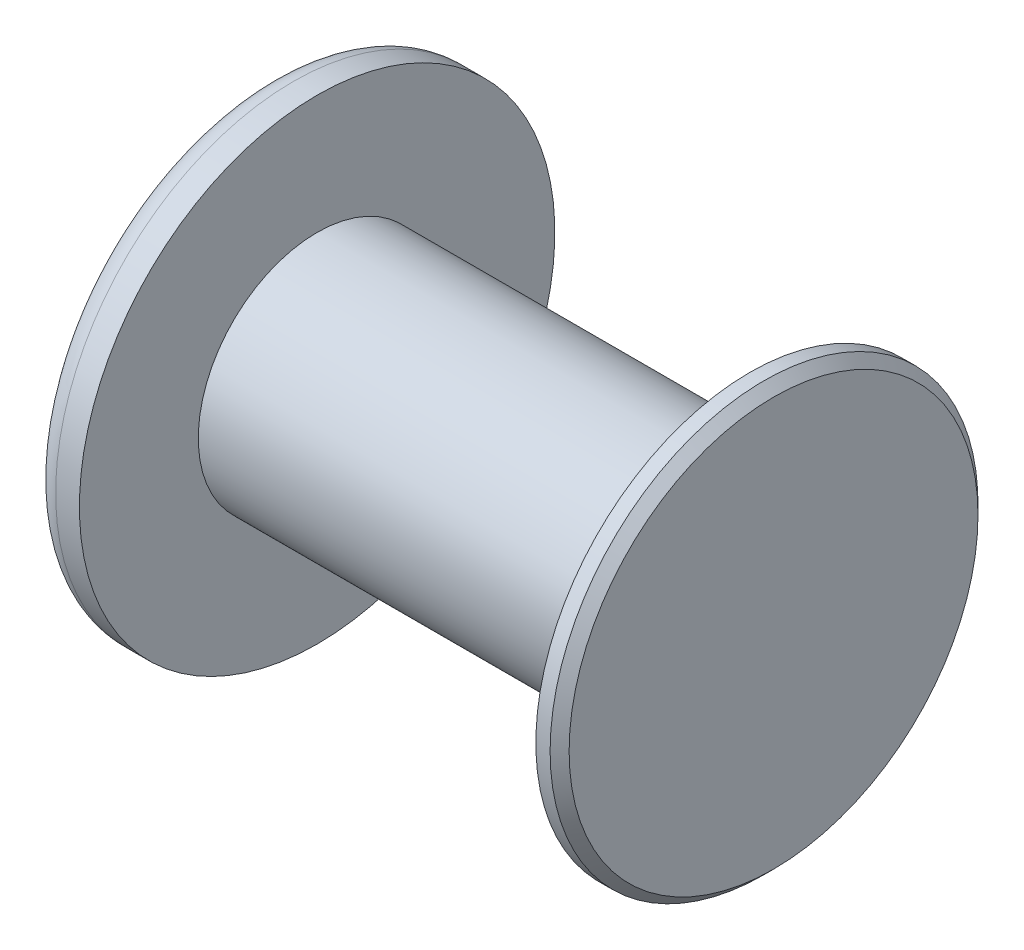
ISO-10303-21;
HEADER;
FILE_DESCRIPTION(('STEP AP214'),'2;1');
FILE_NAME('part.step','',(''),(''),'','','');
FILE_SCHEMA(('AUTOMOTIVE_DESIGN { 1 0 10303 214 1 1 1 1 }'));
ENDSEC;
DATA;
#1=APPLICATION_CONTEXT('core data for automotive mechanical design processes');
#2=APPLICATION_PROTOCOL_DEFINITION('international standard','automotive_design',2000,#1);
#3=PRODUCT_CONTEXT('',#1,'mechanical');
#4=PRODUCT('Part','Part','',(#3));
#5=PRODUCT_RELATED_PRODUCT_CATEGORY('part','',(#4));
#6=PRODUCT_DEFINITION_FORMATION('','',#4);
#7=PRODUCT_DEFINITION_CONTEXT('part definition',#1,'design');
#8=PRODUCT_DEFINITION('design','',#6,#7);
#9=PRODUCT_DEFINITION_SHAPE('','',#8);
#10=(LENGTH_UNIT() NAMED_UNIT(*) SI_UNIT(.MILLI.,.METRE.));
#11=(NAMED_UNIT(*) PLANE_ANGLE_UNIT() SI_UNIT($,.RADIAN.));
#12=(NAMED_UNIT(*) SI_UNIT($,.STERADIAN.) SOLID_ANGLE_UNIT());
#13=UNCERTAINTY_MEASURE_WITH_UNIT(LENGTH_MEASURE(1.E-05),#10,'distance_accuracy_value','');
#14=(GEOMETRIC_REPRESENTATION_CONTEXT(3) GLOBAL_UNCERTAINTY_ASSIGNED_CONTEXT((#13)) GLOBAL_UNIT_ASSIGNED_CONTEXT((#10,
#11,#12)) REPRESENTATION_CONTEXT('',''));
#15=CARTESIAN_POINT('',(0.,0.,0.));
#16=DIRECTION('',(0.,0.,1.));
#17=DIRECTION('',(1.,0.,0.));
#18=AXIS2_PLACEMENT_3D('',#15,#16,#17);
#19=CARTESIAN_POINT('',(5.3,4.5,0.));
#20=DIRECTION('',(-1.,0.,0.));
#21=DIRECTION('',(0.,-1.,0.));
#22=AXIS2_PLACEMENT_3D('',#19,#20,#21);
#23=PLANE('',#22);
#24=CARTESIAN_POINT('',(5.3,0.,0.));
#25=DIRECTION('',(-1.,0.,0.));
#26=DIRECTION('',(0.,-1.,0.));
#27=AXIS2_PLACEMENT_3D('',#24,#25,#26);
#28=CIRCLE('',#27,4.3);
#29=CARTESIAN_POINT('',(5.3,-4.3,0.));
#30=VERTEX_POINT('',#29);
#31=EDGE_CURVE('E10',#30,#30,#28,.F.);
#32=ORIENTED_EDGE('',*,*,#31,.T.);
#33=EDGE_LOOP('',(#32));
#34=FACE_BOUND('',#33,.T.);
#35=ADVANCED_FACE('F40',(#34),#23,.F.);
#36=CARTESIAN_POINT('',(-5.3,0.,0.));
#37=DIRECTION('',(1.,0.,0.));
#38=DIRECTION('',(0.,1.,0.));
#39=AXIS2_PLACEMENT_3D('',#36,#37,#38);
#40=PLANE('',#39);
#41=CARTESIAN_POINT('',(-5.3,0.,0.));
#42=DIRECTION('',(1.,0.,0.));
#43=DIRECTION('',(0.,1.,0.));
#44=AXIS2_PLACEMENT_3D('',#41,#42,#43);
#45=CIRCLE('',#44,4.5);
#46=CARTESIAN_POINT('',(-5.3,4.5,0.));
#47=VERTEX_POINT('',#46);
#48=EDGE_CURVE('E56',#47,#47,#45,.F.);
#49=ORIENTED_EDGE('',*,*,#48,.T.);
#50=EDGE_LOOP('',(#49));
#51=FACE_BOUND('',#50,.T.);
#52=ADVANCED_FACE('F89',(#51),#40,.F.);
#53=CARTESIAN_POINT('',(-5.3,0.,0.));
#54=DIRECTION('',(-1.,0.,0.));
#55=DIRECTION('',(0.,-1.,0.));
#56=AXIS2_PLACEMENT_3D('',#53,#54,#55);
#57=CYLINDRICAL_SURFACE('',#56,5.);
#58=CARTESIAN_POINT('',(-4.8,0.,0.));
#59=DIRECTION('',(1.,0.,0.));
#60=DIRECTION('',(0.,1.,0.));
#61=AXIS2_PLACEMENT_3D('',#58,#59,#60);
#62=CIRCLE('',#61,5.);
#63=CARTESIAN_POINT('',(-4.8,5.,0.));
#64=VERTEX_POINT('',#63);
#65=EDGE_CURVE('E52',#64,#64,#62,.T.);
#66=ORIENTED_EDGE('',*,*,#65,.T.);
#67=EDGE_LOOP('',(#66));
#68=FACE_BOUND('',#67,.T.);
#69=CARTESIAN_POINT('',(-4.3,0.,0.));
#70=DIRECTION('',(-1.,0.,0.));
#71=DIRECTION('',(0.,-1.,0.));
#72=AXIS2_PLACEMENT_3D('',#69,#70,#71);
#73=CIRCLE('',#72,5.);
#74=CARTESIAN_POINT('',(-4.3,-5.,0.));
#75=VERTEX_POINT('',#74);
#76=EDGE_CURVE('E61',#75,#75,#73,.T.);
#77=ORIENTED_EDGE('',*,*,#76,.T.);
#78=EDGE_LOOP('',(#77));
#79=FACE_BOUND('',#78,.T.);
#80=ADVANCED_FACE('F94',(#68,#79),#57,.T.);
#81=CARTESIAN_POINT('',(-4.3,5.,0.));
#82=DIRECTION('',(-1.,0.,0.));
#83=DIRECTION('',(0.,-1.,0.));
#84=AXIS2_PLACEMENT_3D('',#81,#82,#83);
#85=PLANE('',#84);
#86=ORIENTED_EDGE('',*,*,#76,.F.);
#87=EDGE_LOOP('',(#86));
#88=FACE_BOUND('',#87,.T.);
#89=CARTESIAN_POINT('',(-4.3,0.,0.));
#90=DIRECTION('',(-1.,0.,0.));
#91=DIRECTION('',(0.,-1.,0.));
#92=AXIS2_PLACEMENT_3D('',#89,#90,#91);
#93=CIRCLE('',#92,2.5);
#94=CARTESIAN_POINT('',(-4.3,-2.5,0.));
#95=VERTEX_POINT('',#94);
#96=EDGE_CURVE('E64',#95,#95,#93,.T.);
#97=ORIENTED_EDGE('',*,*,#96,.T.);
#98=EDGE_LOOP('',(#97));
#99=FACE_BOUND('',#98,.T.);
#100=ADVANCED_FACE('F100',(#88,#99),#85,.F.);
#101=CARTESIAN_POINT('',(-5.3,0.,0.));
#102=DIRECTION('',(-1.,0.,0.));
#103=DIRECTION('',(0.,-1.,0.));
#104=AXIS2_PLACEMENT_3D('',#101,#102,#103);
#105=CYLINDRICAL_SURFACE('',#104,2.5);
#106=ORIENTED_EDGE('',*,*,#96,.F.);
#107=EDGE_LOOP('',(#106));
#108=FACE_BOUND('',#107,.T.);
#109=CARTESIAN_POINT('',(4.8,0.,0.));
#110=DIRECTION('',(-1.,0.,0.));
#111=DIRECTION('',(0.,-1.,0.));
#112=AXIS2_PLACEMENT_3D('',#109,#110,#111);
#113=CIRCLE('',#112,2.5);
#114=CARTESIAN_POINT('',(4.8,-2.5,0.));
#115=VERTEX_POINT('',#114);
#116=EDGE_CURVE('E67',#115,#115,#113,.T.);
#117=ORIENTED_EDGE('',*,*,#116,.T.);
#118=EDGE_LOOP('',(#117));
#119=FACE_BOUND('',#118,.T.);
#120=ADVANCED_FACE('F85',(#108,#119),#105,.T.);
#121=CARTESIAN_POINT('',(4.8,2.5,0.));
#122=DIRECTION('',(1.,0.,0.));
#123=DIRECTION('',(0.,1.,0.));
#124=AXIS2_PLACEMENT_3D('',#121,#122,#123);
#125=PLANE('',#124);
#126=ORIENTED_EDGE('',*,*,#116,.F.);
#127=EDGE_LOOP('',(#126));
#128=FACE_BOUND('',#127,.T.);
#129=CARTESIAN_POINT('',(4.8,0.,0.));
#130=DIRECTION('',(-1.,0.,0.));
#131=DIRECTION('',(0.,-1.,0.));
#132=AXIS2_PLACEMENT_3D('',#129,#130,#131);
#133=CIRCLE('',#132,4.5);
#134=CARTESIAN_POINT('',(4.8,-4.5,0.));
#135=VERTEX_POINT('',#134);
#136=EDGE_CURVE('E70',#135,#135,#133,.T.);
#137=ORIENTED_EDGE('',*,*,#136,.T.);
#138=EDGE_LOOP('',(#137));
#139=FACE_BOUND('',#138,.T.);
#140=ADVANCED_FACE('F74',(#128,#139),#125,.F.);
#141=CARTESIAN_POINT('',(-5.3,0.,0.));
#142=DIRECTION('',(-1.,0.,0.));
#143=DIRECTION('',(0.,-1.,0.));
#144=AXIS2_PLACEMENT_3D('',#141,#142,#143);
#145=CYLINDRICAL_SURFACE('',#144,4.5);
#146=CARTESIAN_POINT('',(5.1,0.,0.));
#147=DIRECTION('',(-1.,0.,0.));
#148=DIRECTION('',(0.,0.,1.));
#149=AXIS2_PLACEMENT_3D('',#146,#147,#148);
#150=CIRCLE('',#149,4.5);
#151=CARTESIAN_POINT('',(5.1,0.,4.5));
#152=VERTEX_POINT('',#151);
#153=EDGE_CURVE('E48',#152,#152,#150,.T.);
#154=ORIENTED_EDGE('',*,*,#153,.T.);
#155=EDGE_LOOP('',(#154));
#156=FACE_BOUND('',#155,.T.);
#157=ORIENTED_EDGE('',*,*,#136,.F.);
#158=EDGE_LOOP('',(#157));
#159=FACE_BOUND('',#158,.T.);
#160=ADVANCED_FACE('F76',(#156,#159),#145,.T.);
#161=CARTESIAN_POINT('',(-4.8,0.,0.));
#162=DIRECTION('',(1.,0.,0.));
#163=DIRECTION('',(0.,1.,0.));
#164=AXIS2_PLACEMENT_3D('',#161,#162,#163);
#165=TOROIDAL_SURFACE('',#164,4.5,0.5);
#166=ORIENTED_EDGE('',*,*,#65,.F.);
#167=EDGE_LOOP('',(#166));
#168=FACE_BOUND('',#167,.T.);
#169=ORIENTED_EDGE('',*,*,#48,.F.);
#170=EDGE_LOOP('',(#169));
#171=FACE_BOUND('',#170,.T.);
#172=ADVANCED_FACE('F78',(#168,#171),#165,.T.);
#173=CARTESIAN_POINT('',(5.1,0.,0.));
#174=DIRECTION('',(-1.,0.,0.));
#175=DIRECTION('',(0.,0.,1.));
#176=AXIS2_PLACEMENT_3D('',#173,#174,#175);
#177=CONICAL_SURFACE('',#176,4.5,0.785398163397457);
#178=ORIENTED_EDGE('',*,*,#31,.F.);
#179=EDGE_LOOP('',(#178));
#180=FACE_BOUND('',#179,.T.);
#181=ORIENTED_EDGE('',*,*,#153,.F.);
#182=EDGE_LOOP('',(#181));
#183=FACE_BOUND('',#182,.T.);
#184=ADVANCED_FACE('F43',(#180,#183),#177,.T.);
#185=CLOSED_SHELL('',(#35,#52,#80,#100,#120,#140,#160,#172,#184));
#186=MANIFOLD_SOLID_BREP('B2',#185);
#187=ADVANCED_BREP_SHAPE_REPRESENTATION('',(#18,#186),#14);
#188=SHAPE_DEFINITION_REPRESENTATION(#9,#187);
ENDSEC;
END-ISO-10303-21;
